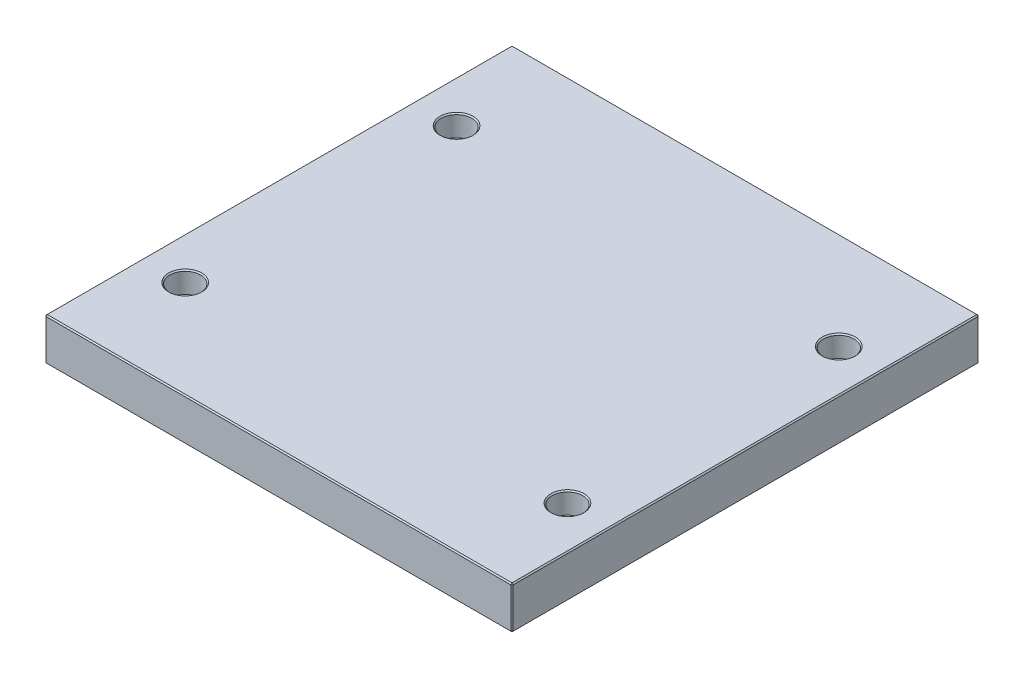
ISO-10303-21;
HEADER;
FILE_DESCRIPTION(('STEP AP214'),'2;1');
FILE_NAME('part.step','',(''),(''),'','','');
FILE_SCHEMA(('AUTOMOTIVE_DESIGN { 1 0 10303 214 1 1 1 1 }'));
ENDSEC;
DATA;
#1=APPLICATION_CONTEXT('core data for automotive mechanical design processes');
#2=APPLICATION_PROTOCOL_DEFINITION('international standard','automotive_design',2000,#1);
#3=PRODUCT_CONTEXT('',#1,'mechanical');
#4=PRODUCT('Part','Part','',(#3));
#5=PRODUCT_RELATED_PRODUCT_CATEGORY('part','',(#4));
#6=PRODUCT_DEFINITION_FORMATION('','',#4);
#7=PRODUCT_DEFINITION_CONTEXT('part definition',#1,'design');
#8=PRODUCT_DEFINITION('design','',#6,#7);
#9=PRODUCT_DEFINITION_SHAPE('','',#8);
#10=(LENGTH_UNIT() NAMED_UNIT(*) SI_UNIT(.MILLI.,.METRE.));
#11=(NAMED_UNIT(*) PLANE_ANGLE_UNIT() SI_UNIT($,.RADIAN.));
#12=(NAMED_UNIT(*) SI_UNIT($,.STERADIAN.) SOLID_ANGLE_UNIT());
#13=UNCERTAINTY_MEASURE_WITH_UNIT(LENGTH_MEASURE(1.E-05),#10,'distance_accuracy_value','');
#14=(GEOMETRIC_REPRESENTATION_CONTEXT(3) GLOBAL_UNCERTAINTY_ASSIGNED_CONTEXT((#13)) GLOBAL_UNIT_ASSIGNED_CONTEXT((#10,
#11,#12)) REPRESENTATION_CONTEXT('',''));
#15=CARTESIAN_POINT('',(0.,0.,0.));
#16=DIRECTION('',(0.,0.,1.));
#17=DIRECTION('',(1.,0.,0.));
#18=AXIS2_PLACEMENT_3D('',#15,#16,#17);
#19=CARTESIAN_POINT('',(-198.,36.,198.));
#20=DIRECTION('',(1.,0.,0.));
#21=DIRECTION('',(0.,0.,-1.));
#22=AXIS2_PLACEMENT_3D('',#19,#20,#21);
#23=PLANE('',#22);
#24=DIRECTION('',(0.,-1.,0.));
#25=VECTOR('',#24,1.);
#26=CARTESIAN_POINT('',(-198.,36.,-197.));
#27=LINE('',#26,#25);
#28=CARTESIAN_POINT('',(-198.,35.,-197.));
#29=VERTEX_POINT('',#28);
#30=CARTESIAN_POINT('',(-198.,1.00000000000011,-197.));
#31=VERTEX_POINT('',#30);
#32=EDGE_CURVE('E115',#29,#31,#27,.T.);
#33=ORIENTED_EDGE('',*,*,#32,.T.);
#34=DIRECTION('',(0.,0.,1.));
#35=VECTOR('',#34,1.);
#36=CARTESIAN_POINT('',(-198.,1.00000000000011,198.));
#37=LINE('',#36,#35);
#38=CARTESIAN_POINT('',(-198.,1.00000000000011,197.));
#39=VERTEX_POINT('',#38);
#40=EDGE_CURVE('E111',#31,#39,#37,.T.);
#41=ORIENTED_EDGE('',*,*,#40,.T.);
#42=DIRECTION('',(0.,1.,0.));
#43=VECTOR('',#42,1.);
#44=CARTESIAN_POINT('',(-198.,36.,197.));
#45=LINE('',#44,#43);
#46=CARTESIAN_POINT('',(-198.,35.,197.));
#47=VERTEX_POINT('',#46);
#48=EDGE_CURVE('E104',#39,#47,#45,.T.);
#49=ORIENTED_EDGE('',*,*,#48,.T.);
#50=DIRECTION('',(0.,0.,-1.));
#51=VECTOR('',#50,1.);
#52=CARTESIAN_POINT('',(-198.,35.,-198.));
#53=LINE('',#52,#51);
#54=EDGE_CURVE('E108',#47,#29,#53,.T.);
#55=ORIENTED_EDGE('',*,*,#54,.T.);
#56=EDGE_LOOP('',(#33,#41,#49,#55));
#57=FACE_BOUND('',#56,.T.);
#58=ADVANCED_FACE('F16',(#57),#23,.F.);
#59=CARTESIAN_POINT('',(198.,36.,198.));
#60=DIRECTION('',(0.,0.,-1.));
#61=DIRECTION('',(-1.,0.,0.));
#62=AXIS2_PLACEMENT_3D('',#59,#60,#61);
#63=PLANE('',#62);
#64=DIRECTION('',(-1.,0.,0.));
#65=VECTOR('',#64,1.);
#66=CARTESIAN_POINT('',(-198.,35.,198.));
#67=LINE('',#66,#65);
#68=CARTESIAN_POINT('',(197.,35.,198.));
#69=VERTEX_POINT('',#68);
#70=CARTESIAN_POINT('',(-197.,35.,198.));
#71=VERTEX_POINT('',#70);
#72=EDGE_CURVE('E170',#69,#71,#67,.T.);
#73=ORIENTED_EDGE('',*,*,#72,.T.);
#74=DIRECTION('',(0.,-1.,0.));
#75=VECTOR('',#74,1.);
#76=CARTESIAN_POINT('',(-197.,36.,198.));
#77=LINE('',#76,#75);
#78=CARTESIAN_POINT('',(-197.,1.00000000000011,198.));
#79=VERTEX_POINT('',#78);
#80=EDGE_CURVE('E123',#71,#79,#77,.T.);
#81=ORIENTED_EDGE('',*,*,#80,.T.);
#82=DIRECTION('',(1.,0.,0.));
#83=VECTOR('',#82,1.);
#84=CARTESIAN_POINT('',(198.,1.00000000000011,198.));
#85=LINE('',#84,#83);
#86=CARTESIAN_POINT('',(197.,1.00000000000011,198.));
#87=VERTEX_POINT('',#86);
#88=EDGE_CURVE('E174',#79,#87,#85,.T.);
#89=ORIENTED_EDGE('',*,*,#88,.T.);
#90=DIRECTION('',(0.,1.,0.));
#91=VECTOR('',#90,1.);
#92=CARTESIAN_POINT('',(197.,36.,198.));
#93=LINE('',#92,#91);
#94=EDGE_CURVE('E172',#87,#69,#93,.T.);
#95=ORIENTED_EDGE('',*,*,#94,.T.);
#96=EDGE_LOOP('',(#73,#81,#89,#95));
#97=FACE_BOUND('',#96,.T.);
#98=ADVANCED_FACE('F317',(#97),#63,.F.);
#99=CARTESIAN_POINT('',(198.,36.,198.));
#100=DIRECTION('',(-1.,0.,0.));
#101=DIRECTION('',(0.,0.,1.));
#102=AXIS2_PLACEMENT_3D('',#99,#100,#101);
#103=PLANE('',#102);
#104=DIRECTION('',(0.,0.,-1.));
#105=VECTOR('',#104,1.);
#106=CARTESIAN_POINT('',(198.,1.00000000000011,198.));
#107=LINE('',#106,#105);
#108=CARTESIAN_POINT('',(198.,1.00000000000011,197.));
#109=VERTEX_POINT('',#108);
#110=CARTESIAN_POINT('',(198.,1.00000000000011,-197.));
#111=VERTEX_POINT('',#110);
#112=EDGE_CURVE('E165',#109,#111,#107,.T.);
#113=ORIENTED_EDGE('',*,*,#112,.T.);
#114=DIRECTION('',(0.,1.,0.));
#115=VECTOR('',#114,1.);
#116=CARTESIAN_POINT('',(198.,36.,-197.));
#117=LINE('',#116,#115);
#118=CARTESIAN_POINT('',(198.,35.,-197.));
#119=VERTEX_POINT('',#118);
#120=EDGE_CURVE('E167',#111,#119,#117,.T.);
#121=ORIENTED_EDGE('',*,*,#120,.T.);
#122=DIRECTION('',(0.,0.,1.));
#123=VECTOR('',#122,1.);
#124=CARTESIAN_POINT('',(198.,35.,198.));
#125=LINE('',#124,#123);
#126=CARTESIAN_POINT('',(198.,35.,197.));
#127=VERTEX_POINT('',#126);
#128=EDGE_CURVE('E161',#119,#127,#125,.T.);
#129=ORIENTED_EDGE('',*,*,#128,.T.);
#130=DIRECTION('',(0.,-1.,0.));
#131=VECTOR('',#130,1.);
#132=CARTESIAN_POINT('',(198.,36.,197.));
#133=LINE('',#132,#131);
#134=EDGE_CURVE('E163',#127,#109,#133,.T.);
#135=ORIENTED_EDGE('',*,*,#134,.T.);
#136=EDGE_LOOP('',(#113,#121,#129,#135));
#137=FACE_BOUND('',#136,.T.);
#138=ADVANCED_FACE('F323',(#137),#103,.F.);
#139=CARTESIAN_POINT('',(198.,36.,-198.));
#140=DIRECTION('',(0.,0.,1.));
#141=DIRECTION('',(1.,0.,0.));
#142=AXIS2_PLACEMENT_3D('',#139,#140,#141);
#143=PLANE('',#142);
#144=DIRECTION('',(0.,-1.,0.));
#145=VECTOR('',#144,1.);
#146=CARTESIAN_POINT('',(197.,36.,-198.));
#147=LINE('',#146,#145);
#148=CARTESIAN_POINT('',(197.,35.,-198.));
#149=VERTEX_POINT('',#148);
#150=CARTESIAN_POINT('',(197.,1.00000000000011,-198.));
#151=VERTEX_POINT('',#150);
#152=EDGE_CURVE('E154',#149,#151,#147,.T.);
#153=ORIENTED_EDGE('',*,*,#152,.T.);
#154=DIRECTION('',(-1.,0.,0.));
#155=VECTOR('',#154,1.);
#156=CARTESIAN_POINT('',(198.,1.00000000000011,-198.));
#157=LINE('',#156,#155);
#158=CARTESIAN_POINT('',(-197.,1.00000000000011,-198.));
#159=VERTEX_POINT('',#158);
#160=EDGE_CURVE('E159',#151,#159,#157,.T.);
#161=ORIENTED_EDGE('',*,*,#160,.T.);
#162=DIRECTION('',(0.,1.,0.));
#163=VECTOR('',#162,1.);
#164=CARTESIAN_POINT('',(-197.,36.,-198.));
#165=LINE('',#164,#163);
#166=CARTESIAN_POINT('',(-197.,35.,-198.));
#167=VERTEX_POINT('',#166);
#168=EDGE_CURVE('E156',#159,#167,#165,.T.);
#169=ORIENTED_EDGE('',*,*,#168,.T.);
#170=DIRECTION('',(1.,0.,0.));
#171=VECTOR('',#170,1.);
#172=CARTESIAN_POINT('',(198.,35.,-198.));
#173=LINE('',#172,#171);
#174=EDGE_CURVE('E152',#167,#149,#173,.T.);
#175=ORIENTED_EDGE('',*,*,#174,.T.);
#176=EDGE_LOOP('',(#153,#161,#169,#175));
#177=FACE_BOUND('',#176,.T.);
#178=ADVANCED_FACE('F465',(#177),#143,.F.);
#179=CARTESIAN_POINT('',(0.,36.,0.));
#180=DIRECTION('',(0.,1.,0.));
#181=DIRECTION('',(0.,0.,1.));
#182=AXIS2_PLACEMENT_3D('',#179,#180,#181);
#183=PLANE('',#182);
#184=CARTESIAN_POINT('',(-162.,36.,115.));
#185=DIRECTION('',(0.,1.,0.));
#186=DIRECTION('',(0.,0.,1.));
#187=AXIS2_PLACEMENT_3D('',#184,#185,#186);
#188=CIRCLE('',#187,14.);
#189=CARTESIAN_POINT('',(-162.,36.,129.));
#190=VERTEX_POINT('',#189);
#191=EDGE_CURVE('E290',#190,#190,#188,.F.);
#192=ORIENTED_EDGE('',*,*,#191,.T.);
#193=EDGE_LOOP('',(#192));
#194=FACE_BOUND('',#193,.T.);
#195=CARTESIAN_POINT('',(162.,36.,115.));
#196=DIRECTION('',(0.,1.,0.));
#197=DIRECTION('',(0.,0.,1.));
#198=AXIS2_PLACEMENT_3D('',#195,#196,#197);
#199=CIRCLE('',#198,13.9999999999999);
#200=CARTESIAN_POINT('',(162.,36.,129.));
#201=VERTEX_POINT('',#200);
#202=EDGE_CURVE('E287',#201,#201,#199,.F.);
#203=ORIENTED_EDGE('',*,*,#202,.T.);
#204=EDGE_LOOP('',(#203));
#205=FACE_BOUND('',#204,.T.);
#206=CARTESIAN_POINT('',(162.,36.,-115.));
#207=DIRECTION('',(0.,1.,0.));
#208=DIRECTION('',(0.,0.,1.));
#209=AXIS2_PLACEMENT_3D('',#206,#207,#208);
#210=CIRCLE('',#209,13.9999999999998);
#211=CARTESIAN_POINT('',(162.,36.,-101.));
#212=VERTEX_POINT('',#211);
#213=EDGE_CURVE('E284',#212,#212,#210,.F.);
#214=ORIENTED_EDGE('',*,*,#213,.T.);
#215=EDGE_LOOP('',(#214));
#216=FACE_BOUND('',#215,.T.);
#217=CARTESIAN_POINT('',(-162.,36.,-115.));
#218=DIRECTION('',(0.,1.,0.));
#219=DIRECTION('',(0.,0.,1.));
#220=AXIS2_PLACEMENT_3D('',#217,#218,#219);
#221=CIRCLE('',#220,14.);
#222=CARTESIAN_POINT('',(-162.,36.,-101.));
#223=VERTEX_POINT('',#222);
#224=EDGE_CURVE('E281',#223,#223,#221,.F.);
#225=ORIENTED_EDGE('',*,*,#224,.T.);
#226=EDGE_LOOP('',(#225));
#227=FACE_BOUND('',#226,.T.);
#228=DIRECTION('',(0.,0.,-1.));
#229=VECTOR('',#228,1.);
#230=CARTESIAN_POINT('',(197.,36.,-198.));
#231=LINE('',#230,#229);
#232=CARTESIAN_POINT('',(197.,36.,197.));
#233=VERTEX_POINT('',#232);
#234=CARTESIAN_POINT('',(197.,36.,-197.));
#235=VERTEX_POINT('',#234);
#236=EDGE_CURVE('E31',#233,#235,#231,.T.);
#237=ORIENTED_EDGE('',*,*,#236,.T.);
#238=DIRECTION('',(-1.,0.,0.));
#239=VECTOR('',#238,1.);
#240=CARTESIAN_POINT('',(-198.,36.,-197.));
#241=LINE('',#240,#239);
#242=CARTESIAN_POINT('',(-197.,36.,-197.));
#243=VERTEX_POINT('',#242);
#244=EDGE_CURVE('E190',#235,#243,#241,.T.);
#245=ORIENTED_EDGE('',*,*,#244,.T.);
#246=DIRECTION('',(0.,0.,1.));
#247=VECTOR('',#246,1.);
#248=CARTESIAN_POINT('',(-197.,36.,198.));
#249=LINE('',#248,#247);
#250=CARTESIAN_POINT('',(-197.,36.,197.));
#251=VERTEX_POINT('',#250);
#252=EDGE_CURVE('E186',#243,#251,#249,.T.);
#253=ORIENTED_EDGE('',*,*,#252,.T.);
#254=DIRECTION('',(1.,0.,0.));
#255=VECTOR('',#254,1.);
#256=CARTESIAN_POINT('',(198.,36.,197.));
#257=LINE('',#256,#255);
#258=EDGE_CURVE('E36',#251,#233,#257,.T.);
#259=ORIENTED_EDGE('',*,*,#258,.T.);
#260=EDGE_LOOP('',(#237,#245,#253,#259));
#261=FACE_BOUND('',#260,.T.);
#262=ADVANCED_FACE('F462',(#194,#205,#216,#227,#261),#183,.T.);
#263=CARTESIAN_POINT('',(0.,0.,0.));
#264=DIRECTION('',(0.,1.,0.));
#265=DIRECTION('',(0.,0.,1.));
#266=AXIS2_PLACEMENT_3D('',#263,#264,#265);
#267=PLANE('',#266);
#268=CARTESIAN_POINT('',(162.,0.,-115.));
#269=DIRECTION('',(0.,1.,0.));
#270=DIRECTION('',(0.,0.,1.));
#271=AXIS2_PLACEMENT_3D('',#268,#269,#270);
#272=CIRCLE('',#271,10.0000000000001);
#273=CARTESIAN_POINT('',(162.,0.,-105.));
#274=VERTEX_POINT('',#273);
#275=EDGE_CURVE('E263',#274,#274,#272,.T.);
#276=ORIENTED_EDGE('',*,*,#275,.T.);
#277=EDGE_LOOP('',(#276));
#278=FACE_BOUND('',#277,.T.);
#279=CARTESIAN_POINT('',(162.,0.,115.));
#280=DIRECTION('',(0.,1.,0.));
#281=DIRECTION('',(0.,0.,1.));
#282=AXIS2_PLACEMENT_3D('',#279,#280,#281);
#283=CIRCLE('',#282,10.);
#284=CARTESIAN_POINT('',(162.,0.,125.));
#285=VERTEX_POINT('',#284);
#286=EDGE_CURVE('E260',#285,#285,#283,.T.);
#287=ORIENTED_EDGE('',*,*,#286,.T.);
#288=EDGE_LOOP('',(#287));
#289=FACE_BOUND('',#288,.T.);
#290=CARTESIAN_POINT('',(-162.,0.,115.));
#291=DIRECTION('',(0.,1.,0.));
#292=DIRECTION('',(0.,0.,1.));
#293=AXIS2_PLACEMENT_3D('',#290,#291,#292);
#294=CIRCLE('',#293,10.);
#295=CARTESIAN_POINT('',(-162.,0.,125.));
#296=VERTEX_POINT('',#295);
#297=EDGE_CURVE('E257',#296,#296,#294,.T.);
#298=ORIENTED_EDGE('',*,*,#297,.T.);
#299=EDGE_LOOP('',(#298));
#300=FACE_BOUND('',#299,.T.);
#301=CARTESIAN_POINT('',(-162.,0.,-115.));
#302=DIRECTION('',(0.,1.,0.));
#303=DIRECTION('',(0.,0.,1.));
#304=AXIS2_PLACEMENT_3D('',#301,#302,#303);
#305=CIRCLE('',#304,10.0000000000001);
#306=CARTESIAN_POINT('',(-162.,0.,-105.));
#307=VERTEX_POINT('',#306);
#308=EDGE_CURVE('E192',#307,#307,#305,.T.);
#309=ORIENTED_EDGE('',*,*,#308,.T.);
#310=EDGE_LOOP('',(#309));
#311=FACE_BOUND('',#310,.T.);
#312=DIRECTION('',(0.,0.,1.));
#313=VECTOR('',#312,1.);
#314=CARTESIAN_POINT('',(197.,0.,0.));
#315=LINE('',#314,#313);
#316=CARTESIAN_POINT('',(197.,0.,-197.));
#317=VERTEX_POINT('',#316);
#318=CARTESIAN_POINT('',(197.,0.,197.));
#319=VERTEX_POINT('',#318);
#320=EDGE_CURVE('E177',#317,#319,#315,.T.);
#321=ORIENTED_EDGE('',*,*,#320,.T.);
#322=DIRECTION('',(-1.,0.,0.));
#323=VECTOR('',#322,1.);
#324=CARTESIAN_POINT('',(0.,0.,197.));
#325=LINE('',#324,#323);
#326=CARTESIAN_POINT('',(-197.,0.,197.));
#327=VERTEX_POINT('',#326);
#328=EDGE_CURVE('E183',#319,#327,#325,.T.);
#329=ORIENTED_EDGE('',*,*,#328,.T.);
#330=DIRECTION('',(0.,0.,-1.));
#331=VECTOR('',#330,1.);
#332=CARTESIAN_POINT('',(-197.,0.,0.));
#333=LINE('',#332,#331);
#334=CARTESIAN_POINT('',(-197.,0.,-197.));
#335=VERTEX_POINT('',#334);
#336=EDGE_CURVE('E181',#327,#335,#333,.T.);
#337=ORIENTED_EDGE('',*,*,#336,.T.);
#338=DIRECTION('',(1.,0.,0.));
#339=VECTOR('',#338,1.);
#340=CARTESIAN_POINT('',(0.,0.,-197.));
#341=LINE('',#340,#339);
#342=EDGE_CURVE('E179',#335,#317,#341,.T.);
#343=ORIENTED_EDGE('',*,*,#342,.T.);
#344=EDGE_LOOP('',(#321,#329,#337,#343));
#345=FACE_BOUND('',#344,.T.);
#346=ADVANCED_FACE('F402',(#278,#289,#300,#311,#345),#267,.F.);
#347=CARTESIAN_POINT('',(198.,36.,197.));
#348=DIRECTION('',(-0.707106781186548,0.,-0.707106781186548));
#349=DIRECTION('',(0.,-1.,0.));
#350=AXIS2_PLACEMENT_3D('',#347,#348,#349);
#351=PLANE('',#350);
#352=DIRECTION('',(-0.707106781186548,0.,0.707106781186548));
#353=VECTOR('',#352,1.);
#354=CARTESIAN_POINT('',(197.,35.,198.));
#355=LINE('',#354,#353);
#356=EDGE_CURVE('E141',#69,#127,#355,.F.);
#357=ORIENTED_EDGE('',*,*,#356,.F.);
#358=ORIENTED_EDGE('',*,*,#94,.F.);
#359=DIRECTION('',(0.707106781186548,0.,-0.707106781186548));
#360=VECTOR('',#359,1.);
#361=CARTESIAN_POINT('',(197.,1.00000000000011,198.));
#362=LINE('',#361,#360);
#363=EDGE_CURVE('E144',#109,#87,#362,.F.);
#364=ORIENTED_EDGE('',*,*,#363,.F.);
#365=ORIENTED_EDGE('',*,*,#134,.F.);
#366=EDGE_LOOP('',(#357,#358,#364,#365));
#367=FACE_BOUND('',#366,.T.);
#368=ADVANCED_FACE('F398',(#367),#351,.F.);
#369=CARTESIAN_POINT('',(197.,35.,198.));
#370=DIRECTION('',(0.577350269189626,0.577350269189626,0.577350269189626));
#371=DIRECTION('',(0.707106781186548,0.,-0.707106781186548));
#372=AXIS2_PLACEMENT_3D('',#369,#370,#371);
#373=PLANE('',#372);
#374=DIRECTION('',(0.,-0.707106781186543,0.707106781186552));
#375=VECTOR('',#374,1.);
#376=CARTESIAN_POINT('',(197.,35.,198.));
#377=LINE('',#376,#375);
#378=EDGE_CURVE('E235',#69,#233,#377,.F.);
#379=ORIENTED_EDGE('',*,*,#378,.F.);
#380=ORIENTED_EDGE('',*,*,#356,.T.);
#381=DIRECTION('',(-0.707106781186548,0.707106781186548,0.));
#382=VECTOR('',#381,1.);
#383=CARTESIAN_POINT('',(197.5,35.5,197.));
#384=LINE('',#383,#382);
#385=EDGE_CURVE('E237',#233,#127,#384,.F.);
#386=ORIENTED_EDGE('',*,*,#385,.F.);
#387=EDGE_LOOP('',(#379,#380,#386));
#388=FACE_BOUND('',#387,.T.);
#389=ADVANCED_FACE('F394',(#388),#373,.T.);
#390=CARTESIAN_POINT('',(197.,1.00000000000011,198.));
#391=DIRECTION('',(0.577350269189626,-0.577350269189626,0.577350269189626));
#392=DIRECTION('',(0.707106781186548,0.,-0.707106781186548));
#393=AXIS2_PLACEMENT_3D('',#390,#391,#392);
#394=PLANE('',#393);
#395=DIRECTION('',(-0.707106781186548,-0.707106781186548,0.));
#396=VECTOR('',#395,1.);
#397=CARTESIAN_POINT('',(197.5,0.500000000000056,197.));
#398=LINE('',#397,#396);
#399=EDGE_CURVE('E229',#109,#319,#398,.T.);
#400=ORIENTED_EDGE('',*,*,#399,.F.);
#401=ORIENTED_EDGE('',*,*,#363,.T.);
#402=DIRECTION('',(0.,0.707106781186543,0.707106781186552));
#403=VECTOR('',#402,1.);
#404=CARTESIAN_POINT('',(197.,1.00000000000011,198.));
#405=LINE('',#404,#403);
#406=EDGE_CURVE('E232',#319,#87,#405,.T.);
#407=ORIENTED_EDGE('',*,*,#406,.F.);
#408=EDGE_LOOP('',(#400,#401,#407));
#409=FACE_BOUND('',#408,.T.);
#410=ADVANCED_FACE('F390',(#409),#394,.T.);
#411=CARTESIAN_POINT('',(197.,36.,0.));
#412=DIRECTION('',(0.707106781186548,0.707106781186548,0.));
#413=DIRECTION('',(0.,0.,1.));
#414=AXIS2_PLACEMENT_3D('',#411,#412,#413);
#415=PLANE('',#414);
#416=ORIENTED_EDGE('',*,*,#385,.T.);
#417=ORIENTED_EDGE('',*,*,#128,.F.);
#418=DIRECTION('',(0.707106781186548,-0.707106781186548,0.));
#419=VECTOR('',#418,1.);
#420=CARTESIAN_POINT('',(198.,35.,-197.));
#421=LINE('',#420,#419);
#422=EDGE_CURVE('E224',#235,#119,#421,.T.);
#423=ORIENTED_EDGE('',*,*,#422,.F.);
#424=ORIENTED_EDGE('',*,*,#236,.F.);
#425=EDGE_LOOP('',(#416,#417,#423,#424));
#426=FACE_BOUND('',#425,.T.);
#427=ADVANCED_FACE('F386',(#426),#415,.T.);
#428=CARTESIAN_POINT('',(0.,36.,197.));
#429=DIRECTION('',(0.,0.707106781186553,0.707106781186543));
#430=DIRECTION('',(-1.,0.,0.));
#431=AXIS2_PLACEMENT_3D('',#428,#429,#430);
#432=PLANE('',#431);
#433=ORIENTED_EDGE('',*,*,#378,.T.);
#434=ORIENTED_EDGE('',*,*,#258,.F.);
#435=DIRECTION('',(0.,0.707106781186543,-0.707106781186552));
#436=VECTOR('',#435,1.);
#437=CARTESIAN_POINT('',(-197.,35.5,197.5));
#438=LINE('',#437,#436);
#439=EDGE_CURVE('E127',#71,#251,#438,.T.);
#440=ORIENTED_EDGE('',*,*,#439,.F.);
#441=ORIENTED_EDGE('',*,*,#72,.F.);
#442=EDGE_LOOP('',(#433,#434,#440,#441));
#443=FACE_BOUND('',#442,.T.);
#444=ADVANCED_FACE('F383',(#443),#432,.T.);
#445=CARTESIAN_POINT('',(-197.,36.,198.));
#446=DIRECTION('',(0.707106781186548,0.,-0.707106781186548));
#447=DIRECTION('',(0.,-1.,0.));
#448=AXIS2_PLACEMENT_3D('',#445,#446,#447);
#449=PLANE('',#448);
#450=DIRECTION('',(0.707106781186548,0.,0.707106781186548));
#451=VECTOR('',#450,1.);
#452=CARTESIAN_POINT('',(-197.,1.00000000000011,198.));
#453=LINE('',#452,#451);
#454=EDGE_CURVE('E128',#79,#39,#453,.F.);
#455=ORIENTED_EDGE('',*,*,#454,.F.);
#456=ORIENTED_EDGE('',*,*,#80,.F.);
#457=DIRECTION('',(-0.707106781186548,0.,-0.707106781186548));
#458=VECTOR('',#457,1.);
#459=CARTESIAN_POINT('',(-198.,35.,197.));
#460=LINE('',#459,#458);
#461=EDGE_CURVE('E119',#47,#71,#460,.F.);
#462=ORIENTED_EDGE('',*,*,#461,.F.);
#463=ORIENTED_EDGE('',*,*,#48,.F.);
#464=EDGE_LOOP('',(#455,#456,#462,#463));
#465=FACE_BOUND('',#464,.T.);
#466=ADVANCED_FACE('F121',(#465),#449,.F.);
#467=CARTESIAN_POINT('',(198.,1.00000000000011,198.));
#468=DIRECTION('',(0.,0.707106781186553,-0.707106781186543));
#469=DIRECTION('',(1.,0.,0.));
#470=AXIS2_PLACEMENT_3D('',#467,#468,#469);
#471=PLANE('',#470);
#472=ORIENTED_EDGE('',*,*,#406,.T.);
#473=ORIENTED_EDGE('',*,*,#88,.F.);
#474=DIRECTION('',(0.,-0.707106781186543,-0.707106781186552));
#475=VECTOR('',#474,1.);
#476=CARTESIAN_POINT('',(-197.,1.00000000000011,198.));
#477=LINE('',#476,#475);
#478=EDGE_CURVE('E220',#327,#79,#477,.F.);
#479=ORIENTED_EDGE('',*,*,#478,.F.);
#480=ORIENTED_EDGE('',*,*,#328,.F.);
#481=EDGE_LOOP('',(#472,#473,#479,#480));
#482=FACE_BOUND('',#481,.T.);
#483=ADVANCED_FACE('F376',(#482),#471,.F.);
#484=CARTESIAN_POINT('',(198.,1.00000000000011,198.));
#485=DIRECTION('',(-0.707106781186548,0.707106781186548,0.));
#486=DIRECTION('',(0.,0.,-1.));
#487=AXIS2_PLACEMENT_3D('',#484,#485,#486);
#488=PLANE('',#487);
#489=ORIENTED_EDGE('',*,*,#399,.T.);
#490=ORIENTED_EDGE('',*,*,#320,.F.);
#491=DIRECTION('',(0.707106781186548,0.707106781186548,0.));
#492=VECTOR('',#491,1.);
#493=CARTESIAN_POINT('',(197.5,0.500000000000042,-197.));
#494=LINE('',#493,#492);
#495=EDGE_CURVE('E217',#111,#317,#494,.F.);
#496=ORIENTED_EDGE('',*,*,#495,.F.);
#497=ORIENTED_EDGE('',*,*,#112,.F.);
#498=EDGE_LOOP('',(#489,#490,#496,#497));
#499=FACE_BOUND('',#498,.T.);
#500=ADVANCED_FACE('F372',(#499),#488,.F.);
#501=CARTESIAN_POINT('',(197.,36.,-198.));
#502=DIRECTION('',(-0.707106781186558,0.,0.707106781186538));
#503=DIRECTION('',(0.,-1.,0.));
#504=AXIS2_PLACEMENT_3D('',#501,#502,#503);
#505=PLANE('',#504);
#506=DIRECTION('',(0.707106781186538,0.,0.707106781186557));
#507=VECTOR('',#506,1.);
#508=CARTESIAN_POINT('',(198.,35.,-197.));
#509=LINE('',#508,#507);
#510=EDGE_CURVE('E226',#119,#149,#509,.F.);
#511=ORIENTED_EDGE('',*,*,#510,.F.);
#512=ORIENTED_EDGE('',*,*,#120,.F.);
#513=DIRECTION('',(-0.707106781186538,0.,-0.707106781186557));
#514=VECTOR('',#513,1.);
#515=CARTESIAN_POINT('',(197.,1.00000000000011,-198.));
#516=LINE('',#515,#514);
#517=EDGE_CURVE('E214',#151,#111,#516,.F.);
#518=ORIENTED_EDGE('',*,*,#517,.F.);
#519=ORIENTED_EDGE('',*,*,#152,.F.);
#520=EDGE_LOOP('',(#511,#512,#518,#519));
#521=FACE_BOUND('',#520,.T.);
#522=ADVANCED_FACE('F368',(#521),#505,.F.);
#523=CARTESIAN_POINT('',(198.,35.,-197.));
#524=DIRECTION('',(0.577350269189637,0.577350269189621,-0.577350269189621));
#525=DIRECTION('',(-0.707106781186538,0.,-0.707106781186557));
#526=AXIS2_PLACEMENT_3D('',#523,#524,#525);
#527=PLANE('',#526);
#528=ORIENTED_EDGE('',*,*,#422,.T.);
#529=ORIENTED_EDGE('',*,*,#510,.T.);
#530=DIRECTION('',(0.,0.707106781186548,0.707106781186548));
#531=VECTOR('',#530,1.);
#532=CARTESIAN_POINT('',(197.,35.5,-197.5));
#533=LINE('',#532,#531);
#534=EDGE_CURVE('E135',#235,#149,#533,.F.);
#535=ORIENTED_EDGE('',*,*,#534,.F.);
#536=EDGE_LOOP('',(#528,#529,#535));
#537=FACE_BOUND('',#536,.T.);
#538=ADVANCED_FACE('F365',(#537),#527,.T.);
#539=CARTESIAN_POINT('',(-198.,35.,197.));
#540=DIRECTION('',(-0.577350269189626,0.577350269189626,0.577350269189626));
#541=DIRECTION('',(0.707106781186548,0.,0.707106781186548));
#542=AXIS2_PLACEMENT_3D('',#539,#540,#541);
#543=PLANE('',#542);
#544=ORIENTED_EDGE('',*,*,#461,.T.);
#545=ORIENTED_EDGE('',*,*,#439,.T.);
#546=DIRECTION('',(-0.707106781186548,-0.707106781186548,0.));
#547=VECTOR('',#546,1.);
#548=CARTESIAN_POINT('',(-198.,35.,197.));
#549=LINE('',#548,#547);
#550=EDGE_CURVE('E131',#47,#251,#549,.F.);
#551=ORIENTED_EDGE('',*,*,#550,.F.);
#552=EDGE_LOOP('',(#544,#545,#551));
#553=FACE_BOUND('',#552,.T.);
#554=ADVANCED_FACE('F132',(#553),#543,.T.);
#555=CARTESIAN_POINT('',(-197.,1.00000000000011,198.));
#556=DIRECTION('',(-0.577350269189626,-0.577350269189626,0.577350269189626));
#557=DIRECTION('',(0.707106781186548,0.,0.707106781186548));
#558=AXIS2_PLACEMENT_3D('',#555,#556,#557);
#559=PLANE('',#558);
#560=ORIENTED_EDGE('',*,*,#478,.T.);
#561=ORIENTED_EDGE('',*,*,#454,.T.);
#562=DIRECTION('',(-0.707106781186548,0.707106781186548,0.));
#563=VECTOR('',#562,1.);
#564=CARTESIAN_POINT('',(-197.5,0.500000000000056,197.));
#565=LINE('',#564,#563);
#566=EDGE_CURVE('E136',#327,#39,#565,.T.);
#567=ORIENTED_EDGE('',*,*,#566,.F.);
#568=EDGE_LOOP('',(#560,#561,#567));
#569=FACE_BOUND('',#568,.T.);
#570=ADVANCED_FACE('F358',(#569),#559,.T.);
#571=CARTESIAN_POINT('',(197.,1.00000000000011,-198.));
#572=DIRECTION('',(0.577350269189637,-0.577350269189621,-0.577350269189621));
#573=DIRECTION('',(-0.707106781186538,0.,-0.707106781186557));
#574=AXIS2_PLACEMENT_3D('',#571,#572,#573);
#575=PLANE('',#574);
#576=ORIENTED_EDGE('',*,*,#517,.T.);
#577=ORIENTED_EDGE('',*,*,#495,.T.);
#578=DIRECTION('',(0.,-0.707106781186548,0.707106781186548));
#579=VECTOR('',#578,1.);
#580=CARTESIAN_POINT('',(197.,1.00000000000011,-198.));
#581=LINE('',#580,#579);
#582=EDGE_CURVE('E207',#151,#317,#581,.T.);
#583=ORIENTED_EDGE('',*,*,#582,.F.);
#584=EDGE_LOOP('',(#576,#577,#583));
#585=FACE_BOUND('',#584,.T.);
#586=ADVANCED_FACE('F354',(#585),#575,.T.);
#587=CARTESIAN_POINT('',(0.,36.,-197.));
#588=DIRECTION('',(0.,0.707106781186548,-0.707106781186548));
#589=DIRECTION('',(1.,0.,0.));
#590=AXIS2_PLACEMENT_3D('',#587,#588,#589);
#591=PLANE('',#590);
#592=ORIENTED_EDGE('',*,*,#534,.T.);
#593=ORIENTED_EDGE('',*,*,#174,.F.);
#594=DIRECTION('',(0.,-0.707106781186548,-0.707106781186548));
#595=VECTOR('',#594,1.);
#596=CARTESIAN_POINT('',(-197.,35.,-198.));
#597=LINE('',#596,#595);
#598=EDGE_CURVE('E204',#243,#167,#597,.T.);
#599=ORIENTED_EDGE('',*,*,#598,.F.);
#600=ORIENTED_EDGE('',*,*,#244,.F.);
#601=EDGE_LOOP('',(#592,#593,#599,#600));
#602=FACE_BOUND('',#601,.T.);
#603=ADVANCED_FACE('F351',(#602),#591,.T.);
#604=CARTESIAN_POINT('',(-197.,36.,0.));
#605=DIRECTION('',(-0.707106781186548,0.707106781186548,0.));
#606=DIRECTION('',(0.,0.,-1.));
#607=AXIS2_PLACEMENT_3D('',#604,#605,#606);
#608=PLANE('',#607);
#609=ORIENTED_EDGE('',*,*,#550,.T.);
#610=ORIENTED_EDGE('',*,*,#252,.F.);
#611=DIRECTION('',(0.707106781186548,0.707106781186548,0.));
#612=VECTOR('',#611,1.);
#613=CARTESIAN_POINT('',(-197.5,35.5,-197.));
#614=LINE('',#613,#612);
#615=EDGE_CURVE('E139',#29,#243,#614,.T.);
#616=ORIENTED_EDGE('',*,*,#615,.F.);
#617=ORIENTED_EDGE('',*,*,#54,.F.);
#618=EDGE_LOOP('',(#609,#610,#616,#617));
#619=FACE_BOUND('',#618,.T.);
#620=ADVANCED_FACE('F138',(#619),#608,.T.);
#621=CARTESIAN_POINT('',(-198.,1.00000000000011,198.));
#622=DIRECTION('',(0.707106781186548,0.707106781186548,0.));
#623=DIRECTION('',(0.,0.,1.));
#624=AXIS2_PLACEMENT_3D('',#621,#622,#623);
#625=PLANE('',#624);
#626=ORIENTED_EDGE('',*,*,#566,.T.);
#627=ORIENTED_EDGE('',*,*,#40,.F.);
#628=DIRECTION('',(0.707106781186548,-0.707106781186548,0.));
#629=VECTOR('',#628,1.);
#630=CARTESIAN_POINT('',(-198.,1.00000000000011,-197.));
#631=LINE('',#630,#629);
#632=EDGE_CURVE('E200',#335,#31,#631,.F.);
#633=ORIENTED_EDGE('',*,*,#632,.F.);
#634=ORIENTED_EDGE('',*,*,#336,.F.);
#635=EDGE_LOOP('',(#626,#627,#633,#634));
#636=FACE_BOUND('',#635,.T.);
#637=ADVANCED_FACE('F344',(#636),#625,.F.);
#638=CARTESIAN_POINT('',(198.,1.00000000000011,-198.));
#639=DIRECTION('',(0.,0.707106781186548,0.707106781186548));
#640=DIRECTION('',(-1.,0.,0.));
#641=AXIS2_PLACEMENT_3D('',#638,#639,#640);
#642=PLANE('',#641);
#643=ORIENTED_EDGE('',*,*,#582,.T.);
#644=ORIENTED_EDGE('',*,*,#342,.F.);
#645=DIRECTION('',(0.,0.707106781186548,-0.707106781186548));
#646=VECTOR('',#645,1.);
#647=CARTESIAN_POINT('',(-197.,0.500000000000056,-197.5));
#648=LINE('',#647,#646);
#649=EDGE_CURVE('E197',#159,#335,#648,.F.);
#650=ORIENTED_EDGE('',*,*,#649,.F.);
#651=ORIENTED_EDGE('',*,*,#160,.F.);
#652=EDGE_LOOP('',(#643,#644,#650,#651));
#653=FACE_BOUND('',#652,.T.);
#654=ADVANCED_FACE('F340',(#653),#642,.F.);
#655=CARTESIAN_POINT('',(-197.,35.,-198.));
#656=DIRECTION('',(-0.577350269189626,0.577350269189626,-0.577350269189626));
#657=DIRECTION('',(-0.707106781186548,0.,0.707106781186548));
#658=AXIS2_PLACEMENT_3D('',#655,#656,#657);
#659=PLANE('',#658);
#660=ORIENTED_EDGE('',*,*,#615,.T.);
#661=ORIENTED_EDGE('',*,*,#598,.T.);
#662=DIRECTION('',(0.707106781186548,0.,-0.707106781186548));
#663=VECTOR('',#662,1.);
#664=CARTESIAN_POINT('',(-197.,35.,-198.));
#665=LINE('',#664,#663);
#666=EDGE_CURVE('E195',#29,#167,#665,.T.);
#667=ORIENTED_EDGE('',*,*,#666,.F.);
#668=EDGE_LOOP('',(#660,#661,#667));
#669=FACE_BOUND('',#668,.T.);
#670=ADVANCED_FACE('F336',(#669),#659,.T.);
#671=CARTESIAN_POINT('',(-198.,1.00000000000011,-197.));
#672=DIRECTION('',(-0.577350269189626,-0.577350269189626,-0.577350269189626));
#673=DIRECTION('',(-0.707106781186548,0.,0.707106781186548));
#674=AXIS2_PLACEMENT_3D('',#671,#672,#673);
#675=PLANE('',#674);
#676=ORIENTED_EDGE('',*,*,#649,.T.);
#677=ORIENTED_EDGE('',*,*,#632,.T.);
#678=DIRECTION('',(-0.707106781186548,0.,0.707106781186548));
#679=VECTOR('',#678,1.);
#680=CARTESIAN_POINT('',(-198.,1.00000000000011,-197.));
#681=LINE('',#680,#679);
#682=EDGE_CURVE('E193',#159,#31,#681,.T.);
#683=ORIENTED_EDGE('',*,*,#682,.F.);
#684=EDGE_LOOP('',(#676,#677,#683));
#685=FACE_BOUND('',#684,.T.);
#686=ADVANCED_FACE('F332',(#685),#675,.T.);
#687=CARTESIAN_POINT('',(-198.,36.,-197.));
#688=DIRECTION('',(0.707106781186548,0.,0.707106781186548));
#689=DIRECTION('',(0.,-1.,0.));
#690=AXIS2_PLACEMENT_3D('',#687,#688,#689);
#691=PLANE('',#690);
#692=ORIENTED_EDGE('',*,*,#666,.T.);
#693=ORIENTED_EDGE('',*,*,#168,.F.);
#694=ORIENTED_EDGE('',*,*,#682,.T.);
#695=ORIENTED_EDGE('',*,*,#32,.F.);
#696=EDGE_LOOP('',(#692,#693,#694,#695));
#697=FACE_BOUND('',#696,.T.);
#698=ADVANCED_FACE('F328',(#697),#691,.F.);
#699=CARTESIAN_POINT('',(-162.,18.,-115.));
#700=DIRECTION('',(0.,1.,0.));
#701=DIRECTION('',(0.,0.,1.));
#702=AXIS2_PLACEMENT_3D('',#699,#700,#701);
#703=CYLINDRICAL_SURFACE('',#702,13.);
#704=CARTESIAN_POINT('',(-162.,35.,-115.));
#705=DIRECTION('',(0.,1.,0.));
#706=DIRECTION('',(0.,0.,1.));
#707=AXIS2_PLACEMENT_3D('',#704,#705,#706);
#708=CIRCLE('',#707,13.);
#709=CARTESIAN_POINT('',(-162.,35.,-102.));
#710=VERTEX_POINT('',#709);
#711=EDGE_CURVE('E10',#710,#710,#708,.T.);
#712=ORIENTED_EDGE('',*,*,#711,.T.);
#713=EDGE_LOOP('',(#712));
#714=FACE_BOUND('',#713,.T.);
#715=CARTESIAN_POINT('',(-162.,18.,-115.));
#716=DIRECTION('',(0.,1.,0.));
#717=DIRECTION('',(0.,0.,1.));
#718=AXIS2_PLACEMENT_3D('',#715,#716,#717);
#719=CIRCLE('',#718,13.);
#720=CARTESIAN_POINT('',(-162.,18.,-102.));
#721=VERTEX_POINT('',#720);
#722=EDGE_CURVE('E147',#721,#721,#719,.T.);
#723=ORIENTED_EDGE('',*,*,#722,.F.);
#724=EDGE_LOOP('',(#723));
#725=FACE_BOUND('',#724,.T.);
#726=ADVANCED_FACE('F331',(#714,#725),#703,.F.);
#727=CARTESIAN_POINT('',(-162.,18.,-115.));
#728=DIRECTION('',(0.,1.,0.));
#729=DIRECTION('',(0.,0.,1.));
#730=AXIS2_PLACEMENT_3D('',#727,#728,#729);
#731=PLANE('',#730);
#732=CARTESIAN_POINT('',(-162.,18.,-115.));
#733=DIRECTION('',(0.,1.,0.));
#734=DIRECTION('',(0.,0.,1.));
#735=AXIS2_PLACEMENT_3D('',#732,#733,#734);
#736=CIRCLE('',#735,9.);
#737=CARTESIAN_POINT('',(-162.,18.,-106.));
#738=VERTEX_POINT('',#737);
#739=EDGE_CURVE('E251',#738,#738,#736,.T.);
#740=ORIENTED_EDGE('',*,*,#739,.F.);
#741=EDGE_LOOP('',(#740));
#742=FACE_BOUND('',#741,.T.);
#743=ORIENTED_EDGE('',*,*,#722,.T.);
#744=EDGE_LOOP('',(#743));
#745=FACE_BOUND('',#744,.T.);
#746=ADVANCED_FACE('F450',(#742,#745),#731,.T.);
#747=CARTESIAN_POINT('',(162.,18.,-115.));
#748=DIRECTION('',(0.,1.,0.));
#749=DIRECTION('',(0.,0.,1.));
#750=AXIS2_PLACEMENT_3D('',#747,#748,#749);
#751=CYLINDRICAL_SURFACE('',#750,13.);
#752=CARTESIAN_POINT('',(162.,35.,-115.));
#753=DIRECTION('',(0.,1.,0.));
#754=DIRECTION('',(0.,0.,1.));
#755=AXIS2_PLACEMENT_3D('',#752,#753,#754);
#756=CIRCLE('',#755,13.);
#757=CARTESIAN_POINT('',(162.,35.,-102.));
#758=VERTEX_POINT('',#757);
#759=EDGE_CURVE('E24',#758,#758,#756,.T.);
#760=ORIENTED_EDGE('',*,*,#759,.T.);
#761=EDGE_LOOP('',(#760));
#762=FACE_BOUND('',#761,.T.);
#763=CARTESIAN_POINT('',(162.,18.,-115.));
#764=DIRECTION('',(0.,1.,0.));
#765=DIRECTION('',(0.,0.,1.));
#766=AXIS2_PLACEMENT_3D('',#763,#764,#765);
#767=CIRCLE('',#766,13.);
#768=CARTESIAN_POINT('',(162.,18.,-102.));
#769=VERTEX_POINT('',#768);
#770=EDGE_CURVE('E441',#769,#769,#767,.T.);
#771=ORIENTED_EDGE('',*,*,#770,.F.);
#772=EDGE_LOOP('',(#771));
#773=FACE_BOUND('',#772,.T.);
#774=ADVANCED_FACE('F298',(#762,#773),#751,.F.);
#775=CARTESIAN_POINT('',(162.,18.,-115.));
#776=DIRECTION('',(0.,1.,0.));
#777=DIRECTION('',(0.,0.,1.));
#778=AXIS2_PLACEMENT_3D('',#775,#776,#777);
#779=PLANE('',#778);
#780=CARTESIAN_POINT('',(162.,18.,-115.));
#781=DIRECTION('',(0.,1.,0.));
#782=DIRECTION('',(0.,0.,1.));
#783=AXIS2_PLACEMENT_3D('',#780,#781,#782);
#784=CIRCLE('',#783,9.);
#785=CARTESIAN_POINT('',(162.,18.,-106.));
#786=VERTEX_POINT('',#785);
#787=EDGE_CURVE('E248',#786,#786,#784,.T.);
#788=ORIENTED_EDGE('',*,*,#787,.F.);
#789=EDGE_LOOP('',(#788));
#790=FACE_BOUND('',#789,.T.);
#791=ORIENTED_EDGE('',*,*,#770,.T.);
#792=EDGE_LOOP('',(#791));
#793=FACE_BOUND('',#792,.T.);
#794=ADVANCED_FACE('F738',(#790,#793),#779,.T.);
#795=CARTESIAN_POINT('',(162.,18.,115.));
#796=DIRECTION('',(0.,1.,0.));
#797=DIRECTION('',(0.,0.,1.));
#798=AXIS2_PLACEMENT_3D('',#795,#796,#797);
#799=CYLINDRICAL_SURFACE('',#798,13.);
#800=CARTESIAN_POINT('',(162.,35.,115.));
#801=DIRECTION('',(0.,1.,0.));
#802=DIRECTION('',(0.,0.,1.));
#803=AXIS2_PLACEMENT_3D('',#800,#801,#802);
#804=CIRCLE('',#803,13.);
#805=CARTESIAN_POINT('',(162.,35.,128.));
#806=VERTEX_POINT('',#805);
#807=EDGE_CURVE('E293',#806,#806,#804,.T.);
#808=ORIENTED_EDGE('',*,*,#807,.T.);
#809=EDGE_LOOP('',(#808));
#810=FACE_BOUND('',#809,.T.);
#811=CARTESIAN_POINT('',(162.,18.,115.));
#812=DIRECTION('',(0.,1.,0.));
#813=DIRECTION('',(0.,0.,1.));
#814=AXIS2_PLACEMENT_3D('',#811,#812,#813);
#815=CIRCLE('',#814,13.);
#816=CARTESIAN_POINT('',(162.,18.,128.));
#817=VERTEX_POINT('',#816);
#818=EDGE_CURVE('E439',#817,#817,#815,.T.);
#819=ORIENTED_EDGE('',*,*,#818,.F.);
#820=EDGE_LOOP('',(#819));
#821=FACE_BOUND('',#820,.T.);
#822=ADVANCED_FACE('F730',(#810,#821),#799,.F.);
#823=CARTESIAN_POINT('',(162.,18.,115.));
#824=DIRECTION('',(0.,1.,0.));
#825=DIRECTION('',(0.,0.,1.));
#826=AXIS2_PLACEMENT_3D('',#823,#824,#825);
#827=PLANE('',#826);
#828=CARTESIAN_POINT('',(162.,18.,115.));
#829=DIRECTION('',(0.,1.,0.));
#830=DIRECTION('',(0.,0.,1.));
#831=AXIS2_PLACEMENT_3D('',#828,#829,#830);
#832=CIRCLE('',#831,9.);
#833=CARTESIAN_POINT('',(162.,18.,124.));
#834=VERTEX_POINT('',#833);
#835=EDGE_CURVE('E245',#834,#834,#832,.T.);
#836=ORIENTED_EDGE('',*,*,#835,.F.);
#837=EDGE_LOOP('',(#836));
#838=FACE_BOUND('',#837,.T.);
#839=ORIENTED_EDGE('',*,*,#818,.T.);
#840=EDGE_LOOP('',(#839));
#841=FACE_BOUND('',#840,.T.);
#842=ADVANCED_FACE('F434',(#838,#841),#827,.T.);
#843=CARTESIAN_POINT('',(-162.,18.,115.));
#844=DIRECTION('',(0.,1.,0.));
#845=DIRECTION('',(0.,0.,1.));
#846=AXIS2_PLACEMENT_3D('',#843,#844,#845);
#847=CYLINDRICAL_SURFACE('',#846,13.);
#848=CARTESIAN_POINT('',(-162.,35.,115.));
#849=DIRECTION('',(0.,1.,0.));
#850=DIRECTION('',(0.,0.,1.));
#851=AXIS2_PLACEMENT_3D('',#848,#849,#850);
#852=CIRCLE('',#851,13.);
#853=CARTESIAN_POINT('',(-162.,35.,128.));
#854=VERTEX_POINT('',#853);
#855=EDGE_CURVE('E278',#854,#854,#852,.T.);
#856=ORIENTED_EDGE('',*,*,#855,.T.);
#857=EDGE_LOOP('',(#856));
#858=FACE_BOUND('',#857,.T.);
#859=CARTESIAN_POINT('',(-162.,18.,115.));
#860=DIRECTION('',(0.,1.,0.));
#861=DIRECTION('',(0.,0.,1.));
#862=AXIS2_PLACEMENT_3D('',#859,#860,#861);
#863=CIRCLE('',#862,13.);
#864=CARTESIAN_POINT('',(-162.,18.,128.));
#865=VERTEX_POINT('',#864);
#866=EDGE_CURVE('E254',#865,#865,#863,.T.);
#867=ORIENTED_EDGE('',*,*,#866,.F.);
#868=EDGE_LOOP('',(#867));
#869=FACE_BOUND('',#868,.T.);
#870=ADVANCED_FACE('F430',(#858,#869),#847,.F.);
#871=CARTESIAN_POINT('',(-162.,18.,115.));
#872=DIRECTION('',(0.,1.,0.));
#873=DIRECTION('',(0.,0.,1.));
#874=AXIS2_PLACEMENT_3D('',#871,#872,#873);
#875=PLANE('',#874);
#876=CARTESIAN_POINT('',(-162.,18.,115.));
#877=DIRECTION('',(0.,1.,0.));
#878=DIRECTION('',(0.,0.,1.));
#879=AXIS2_PLACEMENT_3D('',#876,#877,#878);
#880=CIRCLE('',#879,9.);
#881=CARTESIAN_POINT('',(-162.,18.,124.));
#882=VERTEX_POINT('',#881);
#883=EDGE_CURVE('E242',#882,#882,#880,.T.);
#884=ORIENTED_EDGE('',*,*,#883,.F.);
#885=EDGE_LOOP('',(#884));
#886=FACE_BOUND('',#885,.T.);
#887=ORIENTED_EDGE('',*,*,#866,.T.);
#888=EDGE_LOOP('',(#887));
#889=FACE_BOUND('',#888,.T.);
#890=ADVANCED_FACE('F433',(#886,#889),#875,.T.);
#891=CARTESIAN_POINT('',(-162.,0.,115.));
#892=DIRECTION('',(0.,1.,0.));
#893=DIRECTION('',(0.,0.,1.));
#894=AXIS2_PLACEMENT_3D('',#891,#892,#893);
#895=CYLINDRICAL_SURFACE('',#894,9.);
#896=CARTESIAN_POINT('',(-162.,1.00000000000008,115.));
#897=DIRECTION('',(0.,1.,0.));
#898=DIRECTION('',(0.,0.,1.));
#899=AXIS2_PLACEMENT_3D('',#896,#897,#898);
#900=CIRCLE('',#899,9.);
#901=CARTESIAN_POINT('',(-162.,1.00000000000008,124.));
#902=VERTEX_POINT('',#901);
#903=EDGE_CURVE('E272',#902,#902,#900,.F.);
#904=ORIENTED_EDGE('',*,*,#903,.T.);
#905=EDGE_LOOP('',(#904));
#906=FACE_BOUND('',#905,.T.);
#907=ORIENTED_EDGE('',*,*,#883,.T.);
#908=EDGE_LOOP('',(#907));
#909=FACE_BOUND('',#908,.T.);
#910=ADVANCED_FACE('F705',(#906,#909),#895,.F.);
#911=CARTESIAN_POINT('',(162.,0.,115.));
#912=DIRECTION('',(0.,1.,0.));
#913=DIRECTION('',(0.,0.,1.));
#914=AXIS2_PLACEMENT_3D('',#911,#912,#913);
#915=CYLINDRICAL_SURFACE('',#914,9.);
#916=CARTESIAN_POINT('',(162.,1.00000000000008,115.));
#917=DIRECTION('',(0.,1.,0.));
#918=DIRECTION('',(0.,0.,1.));
#919=AXIS2_PLACEMENT_3D('',#916,#917,#918);
#920=CIRCLE('',#919,9.);
#921=CARTESIAN_POINT('',(162.,1.00000000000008,124.));
#922=VERTEX_POINT('',#921);
#923=EDGE_CURVE('E269',#922,#922,#920,.F.);
#924=ORIENTED_EDGE('',*,*,#923,.T.);
#925=EDGE_LOOP('',(#924));
#926=FACE_BOUND('',#925,.T.);
#927=ORIENTED_EDGE('',*,*,#835,.T.);
#928=EDGE_LOOP('',(#927));
#929=FACE_BOUND('',#928,.T.);
#930=ADVANCED_FACE('F697',(#926,#929),#915,.F.);
#931=CARTESIAN_POINT('',(162.,0.,-115.));
#932=DIRECTION('',(0.,1.,0.));
#933=DIRECTION('',(0.,0.,1.));
#934=AXIS2_PLACEMENT_3D('',#931,#932,#933);
#935=CYLINDRICAL_SURFACE('',#934,9.);
#936=CARTESIAN_POINT('',(162.,1.00000000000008,-115.));
#937=DIRECTION('',(0.,1.,0.));
#938=DIRECTION('',(0.,0.,1.));
#939=AXIS2_PLACEMENT_3D('',#936,#937,#938);
#940=CIRCLE('',#939,9.);
#941=CARTESIAN_POINT('',(162.,1.00000000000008,-106.));
#942=VERTEX_POINT('',#941);
#943=EDGE_CURVE('E266',#942,#942,#940,.F.);
#944=ORIENTED_EDGE('',*,*,#943,.T.);
#945=EDGE_LOOP('',(#944));
#946=FACE_BOUND('',#945,.T.);
#947=ORIENTED_EDGE('',*,*,#787,.T.);
#948=EDGE_LOOP('',(#947));
#949=FACE_BOUND('',#948,.T.);
#950=ADVANCED_FACE('F688',(#946,#949),#935,.F.);
#951=CARTESIAN_POINT('',(-162.,0.,-115.));
#952=DIRECTION('',(0.,1.,0.));
#953=DIRECTION('',(0.,0.,1.));
#954=AXIS2_PLACEMENT_3D('',#951,#952,#953);
#955=CYLINDRICAL_SURFACE('',#954,9.);
#956=CARTESIAN_POINT('',(-162.,1.00000000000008,-115.));
#957=DIRECTION('',(0.,1.,0.));
#958=DIRECTION('',(0.,0.,1.));
#959=AXIS2_PLACEMENT_3D('',#956,#957,#958);
#960=CIRCLE('',#959,9.);
#961=CARTESIAN_POINT('',(-162.,1.00000000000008,-106.));
#962=VERTEX_POINT('',#961);
#963=EDGE_CURVE('E275',#962,#962,#960,.F.);
#964=ORIENTED_EDGE('',*,*,#963,.T.);
#965=EDGE_LOOP('',(#964));
#966=FACE_BOUND('',#965,.T.);
#967=ORIENTED_EDGE('',*,*,#739,.T.);
#968=EDGE_LOOP('',(#967));
#969=FACE_BOUND('',#968,.T.);
#970=ADVANCED_FACE('F408',(#966,#969),#955,.F.);
#971=CARTESIAN_POINT('',(162.,0.,-115.));
#972=DIRECTION('',(0.,-1.,0.));
#973=DIRECTION('',(0.,0.,-1.));
#974=AXIS2_PLACEMENT_3D('',#971,#972,#973);
#975=CONICAL_SURFACE('',#974,10.0000000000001,0.785398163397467);
#976=ORIENTED_EDGE('',*,*,#943,.F.);
#977=EDGE_LOOP('',(#976));
#978=FACE_BOUND('',#977,.T.);
#979=ORIENTED_EDGE('',*,*,#275,.F.);
#980=EDGE_LOOP('',(#979));
#981=FACE_BOUND('',#980,.T.);
#982=ADVANCED_FACE('F404',(#978,#981),#975,.F.);
#983=CARTESIAN_POINT('',(162.,0.,115.));
#984=DIRECTION('',(0.,-1.,0.));
#985=DIRECTION('',(0.,0.,-1.));
#986=AXIS2_PLACEMENT_3D('',#983,#984,#985);
#987=CONICAL_SURFACE('',#986,10.0000000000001,0.78539816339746);
#988=ORIENTED_EDGE('',*,*,#923,.F.);
#989=EDGE_LOOP('',(#988));
#990=FACE_BOUND('',#989,.T.);
#991=ORIENTED_EDGE('',*,*,#286,.F.);
#992=EDGE_LOOP('',(#991));
#993=FACE_BOUND('',#992,.T.);
#994=ADVANCED_FACE('F407',(#990,#993),#987,.F.);
#995=CARTESIAN_POINT('',(-162.,0.,115.));
#996=DIRECTION('',(0.,-1.,0.));
#997=DIRECTION('',(0.,0.,-1.));
#998=AXIS2_PLACEMENT_3D('',#995,#996,#997);
#999=CONICAL_SURFACE('',#998,10.0000000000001,0.78539816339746);
#1000=ORIENTED_EDGE('',*,*,#903,.F.);
#1001=EDGE_LOOP('',(#1000));
#1002=FACE_BOUND('',#1001,.T.);
#1003=ORIENTED_EDGE('',*,*,#297,.F.);
#1004=EDGE_LOOP('',(#1003));
#1005=FACE_BOUND('',#1004,.T.);
#1006=ADVANCED_FACE('F412',(#1002,#1005),#999,.F.);
#1007=CARTESIAN_POINT('',(-162.,0.,-115.));
#1008=DIRECTION('',(0.,-1.,0.));
#1009=DIRECTION('',(0.,0.,-1.));
#1010=AXIS2_PLACEMENT_3D('',#1007,#1008,#1009);
#1011=CONICAL_SURFACE('',#1010,10.0000000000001,0.785398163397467);
#1012=ORIENTED_EDGE('',*,*,#963,.F.);
#1013=EDGE_LOOP('',(#1012));
#1014=FACE_BOUND('',#1013,.T.);
#1015=ORIENTED_EDGE('',*,*,#308,.F.);
#1016=EDGE_LOOP('',(#1015));
#1017=FACE_BOUND('',#1016,.T.);
#1018=ADVANCED_FACE('F416',(#1014,#1017),#1011,.F.);
#1019=CARTESIAN_POINT('',(-162.,35.,115.));
#1020=DIRECTION('',(0.,1.,0.));
#1021=DIRECTION('',(0.,0.,1.));
#1022=AXIS2_PLACEMENT_3D('',#1019,#1020,#1021);
#1023=CONICAL_SURFACE('',#1022,13.,0.785398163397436);
#1024=ORIENTED_EDGE('',*,*,#191,.F.);
#1025=EDGE_LOOP('',(#1024));
#1026=FACE_BOUND('',#1025,.T.);
#1027=ORIENTED_EDGE('',*,*,#855,.F.);
#1028=EDGE_LOOP('',(#1027));
#1029=FACE_BOUND('',#1028,.T.);
#1030=ADVANCED_FACE('F312',(#1026,#1029),#1023,.F.);
#1031=CARTESIAN_POINT('',(162.,35.,115.));
#1032=DIRECTION('',(0.,1.,0.));
#1033=DIRECTION('',(0.,0.,1.));
#1034=AXIS2_PLACEMENT_3D('',#1031,#1032,#1033);
#1035=CONICAL_SURFACE('',#1034,13.,0.785398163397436);
#1036=ORIENTED_EDGE('',*,*,#202,.F.);
#1037=EDGE_LOOP('',(#1036));
#1038=FACE_BOUND('',#1037,.T.);
#1039=ORIENTED_EDGE('',*,*,#807,.F.);
#1040=EDGE_LOOP('',(#1039));
#1041=FACE_BOUND('',#1040,.T.);
#1042=ADVANCED_FACE('F303',(#1038,#1041),#1035,.F.);
#1043=CARTESIAN_POINT('',(162.,35.,-115.));
#1044=DIRECTION('',(0.,1.,0.));
#1045=DIRECTION('',(0.,0.,1.));
#1046=AXIS2_PLACEMENT_3D('',#1043,#1044,#1045);
#1047=CONICAL_SURFACE('',#1046,13.,0.785398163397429);
#1048=ORIENTED_EDGE('',*,*,#213,.F.);
#1049=EDGE_LOOP('',(#1048));
#1050=FACE_BOUND('',#1049,.T.);
#1051=ORIENTED_EDGE('',*,*,#759,.F.);
#1052=EDGE_LOOP('',(#1051));
#1053=FACE_BOUND('',#1052,.T.);
#1054=ADVANCED_FACE('F301',(#1050,#1053),#1047,.F.);
#1055=CARTESIAN_POINT('',(-162.,35.,-115.));
#1056=DIRECTION('',(0.,1.,0.));
#1057=DIRECTION('',(0.,0.,1.));
#1058=AXIS2_PLACEMENT_3D('',#1055,#1056,#1057);
#1059=CONICAL_SURFACE('',#1058,13.,0.785398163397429);
#1060=ORIENTED_EDGE('',*,*,#224,.F.);
#1061=EDGE_LOOP('',(#1060));
#1062=FACE_BOUND('',#1061,.T.);
#1063=ORIENTED_EDGE('',*,*,#711,.F.);
#1064=EDGE_LOOP('',(#1063));
#1065=FACE_BOUND('',#1064,.T.);
#1066=ADVANCED_FACE('F18',(#1062,#1065),#1059,.F.);
#1067=CLOSED_SHELL('',(#58,#98,#138,#178,#262,#346,#368,#389,#410,#427,#444,#466,#483,#500,#522,
#538,#554,#570,#586,#603,#620,#637,#654,#670,#686,#698,#726,#746,#774,#794,#822,#842,#870,#890,
#910,#930,#950,#970,#982,#994,#1006,#1018,#1030,#1042,#1054,#1066));
#1068=MANIFOLD_SOLID_BREP('B1',#1067);
#1069=ADVANCED_BREP_SHAPE_REPRESENTATION('',(#18,#1068),#14);
#1070=SHAPE_DEFINITION_REPRESENTATION(#9,#1069);
ENDSEC;
END-ISO-10303-21;
